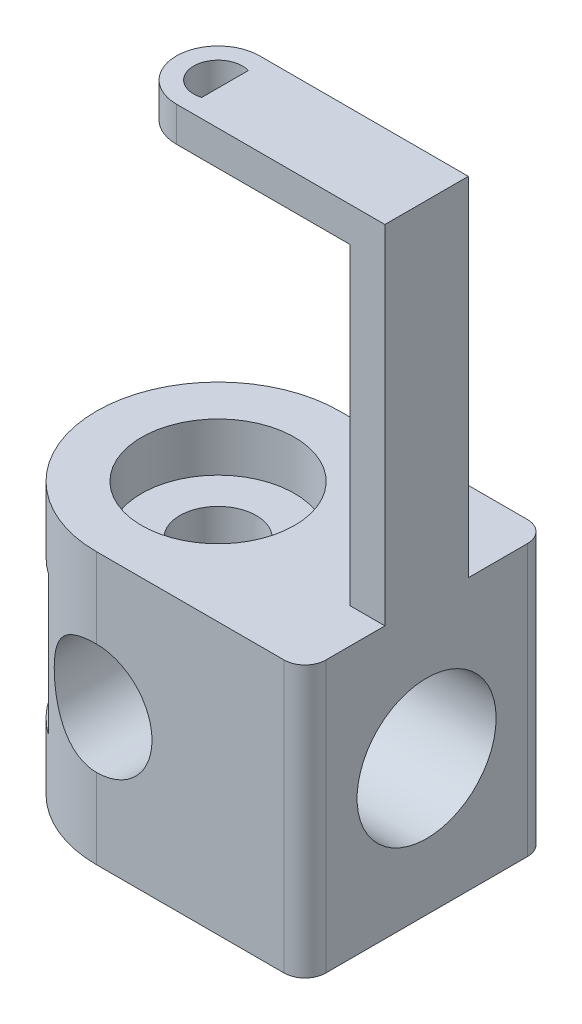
ISO-10303-21;
HEADER;
FILE_DESCRIPTION(('STEP AP214'),'2;1');
FILE_NAME('part.step','',(''),(''),'','','');
FILE_SCHEMA(('AUTOMOTIVE_DESIGN { 1 0 10303 214 1 1 1 1 }'));
ENDSEC;
DATA;
#1=APPLICATION_CONTEXT('core data for automotive mechanical design processes');
#2=APPLICATION_PROTOCOL_DEFINITION('international standard','automotive_design',2000,#1);
#3=PRODUCT_CONTEXT('',#1,'mechanical');
#4=PRODUCT('Part','Part','',(#3));
#5=PRODUCT_RELATED_PRODUCT_CATEGORY('part','',(#4));
#6=PRODUCT_DEFINITION_FORMATION('','',#4);
#7=PRODUCT_DEFINITION_CONTEXT('part definition',#1,'design');
#8=PRODUCT_DEFINITION('design','',#6,#7);
#9=PRODUCT_DEFINITION_SHAPE('','',#8);
#10=(LENGTH_UNIT() NAMED_UNIT(*) SI_UNIT(.MILLI.,.METRE.));
#11=(NAMED_UNIT(*) PLANE_ANGLE_UNIT() SI_UNIT($,.RADIAN.));
#12=(NAMED_UNIT(*) SI_UNIT($,.STERADIAN.) SOLID_ANGLE_UNIT());
#13=UNCERTAINTY_MEASURE_WITH_UNIT(LENGTH_MEASURE(1.E-05),#10,'distance_accuracy_value','');
#14=(GEOMETRIC_REPRESENTATION_CONTEXT(3) GLOBAL_UNCERTAINTY_ASSIGNED_CONTEXT((#13)) GLOBAL_UNIT_ASSIGNED_CONTEXT((#10,
#11,#12)) REPRESENTATION_CONTEXT('',''));
#15=CARTESIAN_POINT('',(0.,0.,0.));
#16=DIRECTION('',(0.,0.,1.));
#17=DIRECTION('',(1.,0.,0.));
#18=AXIS2_PLACEMENT_3D('',#15,#16,#17);
#19=CARTESIAN_POINT('',(-5.,0.,0.));
#20=DIRECTION('',(1.,0.,0.));
#21=DIRECTION('',(0.,0.,-1.));
#22=AXIS2_PLACEMENT_3D('',#19,#20,#21);
#23=PLANE('',#22);
#24=CARTESIAN_POINT('',(-5.,0.,0.));
#25=DIRECTION('',(1.,0.,0.));
#26=DIRECTION('',(0.,0.,-1.));
#27=AXIS2_PLACEMENT_3D('',#24,#25,#26);
#28=CIRCLE('',#27,10.);
#29=CARTESIAN_POINT('',(-5.,0.,-10.));
#30=VERTEX_POINT('',#29);
#31=EDGE_CURVE('E549',#30,#30,#28,.T.);
#32=ORIENTED_EDGE('',*,*,#31,.T.);
#33=EDGE_LOOP('',(#32));
#34=FACE_BOUND('',#33,.T.);
#35=ADVANCED_FACE('F53',(#34),#23,.T.);
#36=CARTESIAN_POINT('',(-14.99996050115,-12.5,0.));
#37=DIRECTION('',(0.,1.,0.));
#38=DIRECTION('',(1.,0.,0.));
#39=AXIS2_PLACEMENT_3D('',#36,#37,#38);
#40=PLANE('',#39);
#41=CARTESIAN_POINT('',(-14.99996050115,-12.5,0.));
#42=DIRECTION('',(0.,-1.,0.));
#43=DIRECTION('',(0.,0.,1.));
#44=AXIS2_PLACEMENT_3D('',#41,#42,#43);
#45=CIRCLE('',#44,5.5);
#46=CARTESIAN_POINT('',(-14.99996050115,-12.5,5.5));
#47=VERTEX_POINT('',#46);
#48=EDGE_CURVE('E11',#47,#47,#45,.T.);
#49=ORIENTED_EDGE('',*,*,#48,.F.);
#50=EDGE_LOOP('',(#49));
#51=FACE_BOUND('',#50,.T.);
#52=CARTESIAN_POINT('',(-14.99996050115,-12.5,0.));
#53=DIRECTION('',(0.,-1.,0.));
#54=DIRECTION('',(0.,0.,1.));
#55=AXIS2_PLACEMENT_3D('',#52,#53,#54);
#56=CIRCLE('',#55,11.);
#57=CARTESIAN_POINT('',(-14.99996050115,-12.5,11.));
#58=VERTEX_POINT('',#57);
#59=CARTESIAN_POINT('',(-3.99996050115,-12.5,0.));
#60=VERTEX_POINT('',#59);
#61=EDGE_CURVE('E490',#58,#60,#56,.T.);
#62=ORIENTED_EDGE('',*,*,#61,.T.);
#63=CARTESIAN_POINT('',(-14.99996050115,-12.5,0.));
#64=DIRECTION('',(0.,-1.,0.));
#65=DIRECTION('',(0.,0.,1.));
#66=AXIS2_PLACEMENT_3D('',#63,#64,#65);
#67=CIRCLE('',#66,11.);
#68=EDGE_CURVE('E540',#60,#58,#67,.T.);
#69=ORIENTED_EDGE('',*,*,#68,.T.);
#70=EDGE_LOOP('',(#62,#69));
#71=FACE_BOUND('',#70,.T.);
#72=ADVANCED_FACE('F596',(#51,#71),#40,.F.);
#73=CARTESIAN_POINT('',(-14.99996050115,12.5,0.));
#74=DIRECTION('',(0.,1.,0.));
#75=DIRECTION('',(0.,0.,1.));
#76=AXIS2_PLACEMENT_3D('',#73,#74,#75);
#77=CYLINDRICAL_SURFACE('',#76,5.5);
#78=CARTESIAN_POINT('',(-14.99996050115,-7.999999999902,5.5));
#79=CARTESIAN_POINT('',(-15.38738832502,-8.000001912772,5.5));
#80=CARTESIAN_POINT('',(-15.77087500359,-7.977488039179,5.467250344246));
#81=CARTESIAN_POINT('',(-16.14461926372,-7.933322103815,5.403003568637));
#82=CARTESIAN_POINT('',(-16.50301971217,-7.870104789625,5.310284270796));
#83=CARTESIAN_POINT('',(-16.8409363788,-7.792081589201,5.193888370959));
#84=CARTESIAN_POINT('',(-17.41154634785,-7.632563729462,4.951027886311));
#85=CARTESIAN_POINT('',(-17.65471076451,-7.553436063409,4.828937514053));
#86=CARTESIAN_POINT('',(-17.88371418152,-7.469002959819,4.696391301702));
#87=CARTESIAN_POINT('',(-18.099075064,-7.380791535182,4.554941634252));
#88=CARTESIAN_POINT('',(-18.30139717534,-7.29008376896,4.405781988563));
#89=CARTESIAN_POINT('',(-18.69946053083,-7.097007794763,4.078759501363));
#90=CARTESIAN_POINT('',(-18.89287151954,-6.994271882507,3.899371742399));
#91=CARTESIAN_POINT('',(-19.07228148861,-6.891213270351,3.71272821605));
#92=CARTESIAN_POINT('',(-19.23839588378,-6.789052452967,3.519543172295));
#93=CARTESIAN_POINT('',(-19.3918003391,-6.688901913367,3.320211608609));
#94=CARTESIAN_POINT('',(-19.69698954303,-6.479039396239,2.876086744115));
#95=CARTESIAN_POINT('',(-19.84454057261,-6.370356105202,2.629020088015));
#96=CARTESIAN_POINT('',(-19.97574617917,-6.267866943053,2.374468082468));
#97=CARTESIAN_POINT('',(-20.09065455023,-6.17361936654,2.113004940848));
#98=CARTESIAN_POINT('',(-20.18916483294,-6.089694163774,1.845014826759));
#99=CARTESIAN_POINT('',(-20.29649242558,-5.995692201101,1.484849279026));
#100=CARTESIAN_POINT('',(-20.32042528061,-5.974499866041,1.398402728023));
#101=CARTESIAN_POINT('',(-20.34268558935,-5.954594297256,1.31141547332));
#102=CARTESIAN_POINT('',(-20.36325717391,-5.936038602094,1.22392414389));
#103=CARTESIAN_POINT('',(-20.38212525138,-5.918890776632,1.135962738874));
#104=CARTESIAN_POINT('',(-20.43259326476,-5.872730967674,0.875842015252));
#105=CARTESIAN_POINT('',(-20.45944399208,-5.847757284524,0.702397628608));
#106=CARTESIAN_POINT('',(-20.47967459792,-5.828718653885,0.527680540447));
#107=CARTESIAN_POINT('',(-20.49319451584,-5.815917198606,0.352114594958));
#108=CARTESIAN_POINT('',(-20.49996050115,-5.809512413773,0.176097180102));
#109=CARTESIAN_POINT('',(-20.49996050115,-5.809512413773,-0.261301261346));
#110=CARTESIAN_POINT('',(-20.48506356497,-5.82361554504,-0.522133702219));
#111=CARTESIAN_POINT('',(-20.45536886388,-5.851728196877,-0.781476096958));
#112=CARTESIAN_POINT('',(-20.41106531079,-5.893127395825,-1.038252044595));
#113=CARTESIAN_POINT('',(-20.35246388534,-5.946457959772,-1.291223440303));
#114=CARTESIAN_POINT('',(-20.19779786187,-6.082347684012,-1.821920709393));
#115=CARTESIAN_POINT('',(-20.09750049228,-6.168061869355,-2.098296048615));
#116=CARTESIAN_POINT('',(-19.97981175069,-6.264829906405,-2.367786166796));
#117=CARTESIAN_POINT('',(-19.84484454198,-6.370377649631,-2.629971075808));
#118=CARTESIAN_POINT('',(-19.69254873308,-6.482467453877,-2.884216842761));
#119=CARTESIAN_POINT('',(-19.32698688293,-6.733014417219,-3.412498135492));
#120=CARTESIAN_POINT('',(-19.10795142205,-6.872898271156,-3.683671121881));
#121=CARTESIAN_POINT('',(-18.86445050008,-7.015672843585,-3.94302028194));
#122=CARTESIAN_POINT('',(-18.59460950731,-7.158529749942,-4.189352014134));
#123=CARTESIAN_POINT('',(-18.29622228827,-7.297972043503,-4.420102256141));
#124=CARTESIAN_POINT('',(-17.74304016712,-7.518911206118,-4.774560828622));
#125=CARTESIAN_POINT('',(-17.50393799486,-7.60499151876,-4.909391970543));
#126=CARTESIAN_POINT('',(-17.24980020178,-7.68583014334,-5.033472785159));
#127=CARTESIAN_POINT('',(-16.98062239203,-7.759489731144,-5.144725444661));
#128=CARTESIAN_POINT('',(-16.69661563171,-7.823893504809,-5.240851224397));
#129=CARTESIAN_POINT('',(-16.0383750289,-7.940742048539,-5.413886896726));
#130=CARTESIAN_POINT('',(-15.65598897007,-7.988268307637,-5.483168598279));
#131=CARTESIAN_POINT('',(-15.26000476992,-8.01382179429,-5.519958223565));
#132=CARTESIAN_POINT('',(-14.85989909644,-8.014597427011,-5.521194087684));
#133=CARTESIAN_POINT('',(-14.46529152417,-7.991263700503,-5.487488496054));
#134=CARTESIAN_POINT('',(-13.86762701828,-7.922486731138,-5.386706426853));
#135=CARTESIAN_POINT('',(-13.65506841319,-7.890769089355,-5.340068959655));
#136=CARTESIAN_POINT('',(-13.44845091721,-7.85302945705,-5.28428450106));
#137=CARTESIAN_POINT('',(-13.24841407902,-7.809995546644,-5.220197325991));
#138=CARTESIAN_POINT('',(-13.05553539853,-7.762472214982,-5.148743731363));
#139=CARTESIAN_POINT('',(-12.61008604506,-7.639450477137,-4.961670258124));
#140=CARTESIAN_POINT('',(-12.36452216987,-7.560288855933,-4.83968829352));
#141=CARTESIAN_POINT('',(-12.13329886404,-7.475668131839,-4.707034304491));
#142=CARTESIAN_POINT('',(-11.91589998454,-7.387153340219,-4.565304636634));
#143=CARTESIAN_POINT('',(-11.71171903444,-7.296059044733,-4.415730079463));
#144=CARTESIAN_POINT('',(-11.3063022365,-7.10021073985,-4.08449943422));
#145=CARTESIAN_POINT('',(-11.10796569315,-6.995003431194,-3.900973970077));
#146=CARTESIAN_POINT('',(-10.92431592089,-6.889444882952,-3.709838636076));
#147=CARTESIAN_POINT('',(-10.75459473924,-6.784844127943,-3.511860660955));
#148=CARTESIAN_POINT('',(-10.59817614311,-6.682392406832,-3.307457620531));
#149=CARTESIAN_POINT('',(-10.29187205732,-6.470908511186,-2.857879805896));
#150=CARTESIAN_POINT('',(-10.14556428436,-6.362760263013,-2.610752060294));
#151=CARTESIAN_POINT('',(-10.01554068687,-6.260881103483,-2.356181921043));
#152=CARTESIAN_POINT('',(-9.901766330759,-6.16731616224,-2.094745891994));
#153=CARTESIAN_POINT('',(-9.804350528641,-6.08413900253,-1.826832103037));
#154=CARTESIAN_POINT('',(-9.650180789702,-5.948864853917,-1.30292911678));
#155=CARTESIAN_POINT('',(-9.590502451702,-5.894593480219,-1.047753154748));
#156=CARTESIAN_POINT('',(-9.545380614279,-5.852438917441,-0.788674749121));
#157=CARTESIAN_POINT('',(-9.515135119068,-5.823804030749,-0.526964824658));
#158=CARTESIAN_POINT('',(-9.49996050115,-5.80943762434,-0.263725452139));
#159=CARTESIAN_POINT('',(-9.49996050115,-5.80943762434,0.175574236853));
#160=CARTESIAN_POINT('',(-9.506686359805,-5.815804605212,0.351069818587));
#161=CARTESIAN_POINT('',(-9.520126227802,-5.828530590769,0.526117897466));
#162=CARTESIAN_POINT('',(-9.54023731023,-5.84745793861,0.700324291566));
#163=CARTESIAN_POINT('',(-9.566930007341,-5.872287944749,0.873268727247));
#164=CARTESIAN_POINT('',(-9.617108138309,-5.918193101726,1.132681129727));
#165=CARTESIAN_POINT('',(-9.635872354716,-5.935251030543,1.220422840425));
#166=CARTESIAN_POINT('',(-9.656331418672,-5.953710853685,1.307697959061));
#167=CARTESIAN_POINT('',(-9.678470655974,-5.97351511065,1.394472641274));
#168=CARTESIAN_POINT('',(-9.702274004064,-5.994601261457,1.480710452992));
#169=CARTESIAN_POINT('',(-9.80874178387,-6.087893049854,1.839069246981));
#170=CARTESIAN_POINT('',(-9.906331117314,-6.171090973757,2.105545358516));
#171=CARTESIAN_POINT('',(-10.0201251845,-6.26452156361,2.365583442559));
#172=CARTESIAN_POINT('',(-10.15002055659,-6.366140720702,2.61880334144));
#173=CARTESIAN_POINT('',(-10.2960578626,-6.473934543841,2.864639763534));
#174=CARTESIAN_POINT('',(-10.65536239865,-6.721707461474,3.390629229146));
#175=CARTESIAN_POINT('',(-10.87632236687,-6.863652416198,3.666943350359));
#176=CARTESIAN_POINT('',(-11.12246798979,-7.008733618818,3.931124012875));
#177=CARTESIAN_POINT('',(-11.39574003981,-7.154013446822,4.181943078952));
#178=CARTESIAN_POINT('',(-11.6984350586,-7.29583408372,4.416729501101));
#179=CARTESIAN_POINT('',(-12.25688071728,-7.518882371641,4.77456075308));
#180=CARTESIAN_POINT('',(-12.4959827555,-7.604965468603,4.909391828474));
#181=CARTESIAN_POINT('',(-12.75012044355,-7.685806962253,5.033472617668));
#182=CARTESIAN_POINT('',(-13.01929822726,-7.759469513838,5.144725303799));
#183=CARTESIAN_POINT('',(-13.30330509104,-7.823876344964,5.240851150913));
#184=CARTESIAN_POINT('',(-13.82117604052,-7.915812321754,5.376987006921));
#185=CARTESIAN_POINT('',(-14.04849859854,-7.948595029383,5.425121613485));
#186=CARTESIAN_POINT('',(-14.28187782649,-7.974039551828,5.462244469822));
#187=CARTESIAN_POINT('',(-14.5194949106,-7.991323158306,5.487382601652));
#188=CARTESIAN_POINT('',(-14.75948272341,-7.999998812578,5.5));
#189=CARTESIAN_POINT('',(-14.99996050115,-7.999999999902,5.5));
#190=(BOUNDED_CURVE() B_SPLINE_CURVE(6,(#78,#79,#80,#81,#82,#83,#84,#85,#86,#87,#88,#89,#90,#91,
#92,#93,#94,#95,#96,#97,#98,#99,#100,#101,#102,#103,#104,#105,#106,#107,#108,#109,#110,#111,
#112,#113,#114,#115,#116,#117,#118,#119,#120,#121,#122,#123,#124,#125,#126,#127,#128,#129,#130,
#131,#132,#133,#134,#135,#136,#137,#138,#139,#140,#141,#142,#143,#144,#145,#146,#147,#148,#149,
#150,#151,#152,#153,#154,#155,#156,#157,#158,#159,#160,#161,#162,#163,#164,#165,#166,#167,#168,
#169,#170,#171,#172,#173,#174,#175,#176,#177,#178,#179,#180,#181,#182,#183,#184,#185,#186,#187,
#188,#189),.UNSPECIFIED.,.T.,.F.) B_SPLINE_CURVE_WITH_KNOTS((7,5,5,5,5,5,5,5,5,5,5,5,5,5,5,5,5,
5,5,5,5,5,7),(0.,0.05273742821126,0.0961618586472,0.14376396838,0.199129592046,0.216461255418,
0.250128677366,0.300085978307,0.357175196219,0.422960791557,0.467800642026,0.521891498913,
0.55290493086,0.5964836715,0.645123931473,0.700285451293,0.750530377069,0.783980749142,
0.801205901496,0.856040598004,0.922549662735,0.967168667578,1.),
.UNSPECIFIED.) CURVE() GEOMETRIC_REPRESENTATION_ITEM() RATIONAL_B_SPLINE_CURVE((1.,1.,1.,1.,1.,
1.,1.,1.,1.,1.,1.,1.,1.,1.,1.,1.,1.,1.,1.,1.,1.,1.,1.,1.,1.,1.,1.,1.,1.,1.,1.,1.,1.,1.,1.,1.,1.,
1.,1.,1.,1.,1.,1.,1.,1.,1.,1.,1.,1.,1.,1.,1.,1.,1.,1.,1.,1.,1.,1.,1.,1.,1.,1.,1.,1.,1.,1.,1.,1.,
1.,1.,1.,1.,1.,1.,1.,1.,1.,1.,1.,1.,1.,1.,1.,1.,1.,1.,1.,1.,1.,1.,1.,1.,1.,1.,1.,1.,1.,1.,1.,1.,
1.,1.,1.,1.,1.,1.,1.,1.,1.,1.,1.)) REPRESENTATION_ITEM(''));
#191=CARTESIAN_POINT('',(-14.99996050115,-7.999999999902,5.5));
#192=VERTEX_POINT('',#191);
#193=EDGE_CURVE('E366',#192,#192,#190,.T.);
#194=ORIENTED_EDGE('',*,*,#193,.F.);
#195=DIRECTION('',(0.,-1.,0.));
#196=VECTOR('',#195,1.);
#197=CARTESIAN_POINT('',(-14.99996050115,12.5,5.5));
#198=LINE('',#197,#196);
#199=EDGE_CURVE('E56',#192,#47,#198,.T.);
#200=ORIENTED_EDGE('',*,*,#199,.T.);
#201=ORIENTED_EDGE('',*,*,#48,.T.);
#202=ORIENTED_EDGE('',*,*,#199,.F.);
#203=EDGE_LOOP('',(#194,#200,#201,#202));
#204=FACE_BOUND('',#203,.T.);
#205=ADVANCED_FACE('F602',(#204),#77,.F.);
#206=CARTESIAN_POINT('',(-14.99996050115,12.5,0.));
#207=DIRECTION('',(0.,1.,0.));
#208=DIRECTION('',(0.,0.,1.));
#209=AXIS2_PLACEMENT_3D('',#206,#207,#208);
#210=CYLINDRICAL_SURFACE('',#209,5.5);
#211=CARTESIAN_POINT('',(-14.99996050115,12.5,0.));
#212=DIRECTION('',(0.,-1.,0.));
#213=DIRECTION('',(0.,0.,1.));
#214=AXIS2_PLACEMENT_3D('',#211,#212,#213);
#215=CIRCLE('',#214,5.5);
#216=CARTESIAN_POINT('',(-14.99996050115,12.5,5.5));
#217=VERTEX_POINT('',#216);
#218=EDGE_CURVE('E553',#217,#217,#215,.T.);
#219=ORIENTED_EDGE('',*,*,#218,.F.);
#220=DIRECTION('',(0.,-1.,0.));
#221=VECTOR('',#220,1.);
#222=CARTESIAN_POINT('',(-14.99996050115,12.5,5.5));
#223=LINE('',#222,#221);
#224=CARTESIAN_POINT('',(-14.99996050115,7.999999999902,5.5));
#225=VERTEX_POINT('',#224);
#226=EDGE_CURVE('E550',#217,#225,#223,.T.);
#227=ORIENTED_EDGE('',*,*,#226,.T.);
#228=CARTESIAN_POINT('',(-14.99996050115,7.999999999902,5.5));
#229=CARTESIAN_POINT('',(-15.38738832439,8.000001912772,5.5));
#230=CARTESIAN_POINT('',(-15.77087500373,7.977488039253,5.467250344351));
#231=CARTESIAN_POINT('',(-16.14461926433,7.933322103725,5.403003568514));
#232=CARTESIAN_POINT('',(-16.50301971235,7.870104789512,5.310284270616));
#233=CARTESIAN_POINT('',(-16.84093637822,7.792081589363,5.193888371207));
#234=CARTESIAN_POINT('',(-17.41154634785,7.632563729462,4.951027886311));
#235=CARTESIAN_POINT('',(-17.65471076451,7.553436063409,4.828937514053));
#236=CARTESIAN_POINT('',(-17.88371418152,7.469002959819,4.696391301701));
#237=CARTESIAN_POINT('',(-18.099075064,7.380791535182,4.554941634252));
#238=CARTESIAN_POINT('',(-18.30139717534,7.29008376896,4.405781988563));
#239=CARTESIAN_POINT('',(-18.69946051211,7.097007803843,4.078759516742));
#240=CARTESIAN_POINT('',(-18.89287154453,6.994271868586,3.899371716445));
#241=CARTESIAN_POINT('',(-19.07228149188,6.891213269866,3.712728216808));
#242=CARTESIAN_POINT('',(-19.23839586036,6.789052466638,3.519543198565));
#243=CARTESIAN_POINT('',(-19.39180035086,6.68890190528,3.320211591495));
#244=CARTESIAN_POINT('',(-19.69698954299,6.47903939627,2.876086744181));
#245=CARTESIAN_POINT('',(-19.84454057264,6.370356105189,2.629020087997));
#246=CARTESIAN_POINT('',(-19.9757461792,6.267866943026,2.374468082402));
#247=CARTESIAN_POINT('',(-20.09065455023,6.173619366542,2.113004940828));
#248=CARTESIAN_POINT('',(-20.18916483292,6.089694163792,1.845014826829));
#249=CARTESIAN_POINT('',(-20.29649242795,5.995692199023,1.484849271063));
#250=CARTESIAN_POINT('',(-20.32042528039,5.974499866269,1.398402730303));
#251=CARTESIAN_POINT('',(-20.34268558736,5.95459429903,1.311415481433));
#252=CARTESIAN_POINT('',(-20.36325717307,5.936038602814,1.223924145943));
#253=CARTESIAN_POINT('',(-20.38212525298,5.918890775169,1.135962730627));
#254=CARTESIAN_POINT('',(-20.43259326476,5.872730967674,0.875842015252));
#255=CARTESIAN_POINT('',(-20.45944399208,5.847757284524,0.702397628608));
#256=CARTESIAN_POINT('',(-20.47967459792,5.828718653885,0.527680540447));
#257=CARTESIAN_POINT('',(-20.49319451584,5.815917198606,0.352114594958));
#258=CARTESIAN_POINT('',(-20.49996050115,5.809512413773,0.176097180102));
#259=CARTESIAN_POINT('',(-20.49996050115,5.809512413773,-0.261301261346));
#260=CARTESIAN_POINT('',(-20.48506356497,5.82361554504,-0.52213370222));
#261=CARTESIAN_POINT('',(-20.45536886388,5.851728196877,-0.781476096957));
#262=CARTESIAN_POINT('',(-20.41106531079,5.893127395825,-1.038252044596));
#263=CARTESIAN_POINT('',(-20.35246388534,5.946457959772,-1.291223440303));
#264=CARTESIAN_POINT('',(-20.19779786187,6.082347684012,-1.821920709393));
#265=CARTESIAN_POINT('',(-20.09750049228,6.168061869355,-2.098296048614));
#266=CARTESIAN_POINT('',(-19.97981175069,6.264829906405,-2.367786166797));
#267=CARTESIAN_POINT('',(-19.84484454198,6.370377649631,-2.629971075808));
#268=CARTESIAN_POINT('',(-19.69254873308,6.482467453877,-2.88421684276));
#269=CARTESIAN_POINT('',(-19.32698688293,6.733014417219,-3.412498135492));
#270=CARTESIAN_POINT('',(-19.10795142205,6.872898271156,-3.683671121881));
#271=CARTESIAN_POINT('',(-18.86445050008,7.015672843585,-3.94302028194));
#272=CARTESIAN_POINT('',(-18.59460950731,7.158529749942,-4.189352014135));
#273=CARTESIAN_POINT('',(-18.29622228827,7.297972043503,-4.420102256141));
#274=CARTESIAN_POINT('',(-17.74304016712,7.518911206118,-4.774560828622));
#275=CARTESIAN_POINT('',(-17.50393799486,7.60499151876,-4.909391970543));
#276=CARTESIAN_POINT('',(-17.24980020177,7.68583014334,-5.033472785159));
#277=CARTESIAN_POINT('',(-16.98062239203,7.759489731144,-5.144725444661));
#278=CARTESIAN_POINT('',(-16.69661563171,7.823893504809,-5.240851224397));
#279=CARTESIAN_POINT('',(-16.0383750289,7.940742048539,-5.413886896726));
#280=CARTESIAN_POINT('',(-15.65598897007,7.988268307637,-5.483168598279));
#281=CARTESIAN_POINT('',(-15.26000476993,8.01382179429,-5.519958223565));
#282=CARTESIAN_POINT('',(-14.85989909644,8.014597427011,-5.521194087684));
#283=CARTESIAN_POINT('',(-14.46529152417,7.991263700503,-5.487488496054));
#284=CARTESIAN_POINT('',(-13.86762701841,7.922486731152,-5.386706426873));
#285=CARTESIAN_POINT('',(-13.65506841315,7.890769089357,-5.340068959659));
#286=CARTESIAN_POINT('',(-13.4484509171,7.853029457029,-5.284284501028));
#287=CARTESIAN_POINT('',(-13.248414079,7.80999554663,-5.220197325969));
#288=CARTESIAN_POINT('',(-13.05553539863,7.762472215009,-5.148743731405));
#289=CARTESIAN_POINT('',(-12.61008604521,7.639450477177,-4.961670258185));
#290=CARTESIAN_POINT('',(-12.36452216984,7.560288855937,-4.839688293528));
#291=CARTESIAN_POINT('',(-12.13329886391,7.47566813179,-4.707034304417));
#292=CARTESIAN_POINT('',(-11.9158999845,7.387153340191,-4.565304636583));
#293=CARTESIAN_POINT('',(-11.71171903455,7.296059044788,-4.415730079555));
#294=CARTESIAN_POINT('',(-11.30630225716,7.10021074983,-4.084499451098));
#295=CARTESIAN_POINT('',(-11.10796566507,6.995003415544,-3.900973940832));
#296=CARTESIAN_POINT('',(-10.92431591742,6.88944488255,-3.709838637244));
#297=CARTESIAN_POINT('',(-10.75459476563,6.784844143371,-3.511860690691));
#298=CARTESIAN_POINT('',(-10.5981761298,6.682392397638,-3.307457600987));
#299=CARTESIAN_POINT('',(-10.29187205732,6.470908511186,-2.857879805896));
#300=CARTESIAN_POINT('',(-10.14556428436,6.362760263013,-2.610752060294));
#301=CARTESIAN_POINT('',(-10.01554068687,6.260881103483,-2.356181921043));
#302=CARTESIAN_POINT('',(-9.901766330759,6.16731616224,-2.094745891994));
#303=CARTESIAN_POINT('',(-9.804350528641,6.08413900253,-1.826832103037));
#304=CARTESIAN_POINT('',(-9.650180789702,5.948864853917,-1.30292911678));
#305=CARTESIAN_POINT('',(-9.590502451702,5.894593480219,-1.047753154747));
#306=CARTESIAN_POINT('',(-9.54538061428,5.852438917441,-0.788674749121));
#307=CARTESIAN_POINT('',(-9.515135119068,5.823804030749,-0.526964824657));
#308=CARTESIAN_POINT('',(-9.49996050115,5.80943762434,-0.263725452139));
#309=CARTESIAN_POINT('',(-9.49996050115,5.80943762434,0.175574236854));
#310=CARTESIAN_POINT('',(-9.506686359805,5.815804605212,0.351069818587));
#311=CARTESIAN_POINT('',(-9.520126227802,5.828530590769,0.526117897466));
#312=CARTESIAN_POINT('',(-9.54023731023,5.84745793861,0.700324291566));
#313=CARTESIAN_POINT('',(-9.566930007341,5.872287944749,0.873268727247));
#314=CARTESIAN_POINT('',(-9.61710813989,5.918193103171,1.132681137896));
#315=CARTESIAN_POINT('',(-9.635872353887,5.935251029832,1.220422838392));
#316=CARTESIAN_POINT('',(-9.65633141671,5.953710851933,1.307697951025));
#317=CARTESIAN_POINT('',(-9.678470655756,5.973515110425,1.394472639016));
#318=CARTESIAN_POINT('',(-9.702274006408,5.99460126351,1.48071046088));
#319=CARTESIAN_POINT('',(-9.80874178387,6.087893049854,1.839069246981));
#320=CARTESIAN_POINT('',(-9.906331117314,6.171090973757,2.105545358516));
#321=CARTESIAN_POINT('',(-10.0201251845,6.26452156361,2.365583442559));
#322=CARTESIAN_POINT('',(-10.15002055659,6.366140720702,2.618803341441));
#323=CARTESIAN_POINT('',(-10.29605786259,6.473934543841,2.864639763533));
#324=CARTESIAN_POINT('',(-10.65536239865,6.721707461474,3.390629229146));
#325=CARTESIAN_POINT('',(-10.87632236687,6.863652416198,3.666943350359));
#326=CARTESIAN_POINT('',(-11.12246798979,7.008733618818,3.931124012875));
#327=CARTESIAN_POINT('',(-11.39574003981,7.154013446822,4.181943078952));
#328=CARTESIAN_POINT('',(-11.6984350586,7.29583408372,4.416729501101));
#329=CARTESIAN_POINT('',(-12.25688071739,7.518882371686,4.774560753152));
#330=CARTESIAN_POINT('',(-12.49598275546,7.604965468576,4.909391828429));
#331=CARTESIAN_POINT('',(-12.75012044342,7.685806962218,5.033472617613));
#332=CARTESIAN_POINT('',(-13.01929822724,7.759469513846,5.144725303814));
#333=CARTESIAN_POINT('',(-13.30330509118,7.823876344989,5.240851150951));
#334=CARTESIAN_POINT('',(-13.82117604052,7.915812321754,5.376987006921));
#335=CARTESIAN_POINT('',(-14.04849859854,7.948595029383,5.425121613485));
#336=CARTESIAN_POINT('',(-14.28187782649,7.974039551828,5.462244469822));
#337=CARTESIAN_POINT('',(-14.5194949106,7.991323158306,5.487382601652));
#338=CARTESIAN_POINT('',(-14.75948272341,7.999998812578,5.5));
#339=CARTESIAN_POINT('',(-14.99996050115,7.999999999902,5.5));
#340=(BOUNDED_CURVE() B_SPLINE_CURVE(6,(#228,#229,#230,#231,#232,#233,#234,#235,#236,#237,#238,
#239,#240,#241,#242,#243,#244,#245,#246,#247,#248,#249,#250,#251,#252,#253,#254,#255,#256,#257,
#258,#259,#260,#261,#262,#263,#264,#265,#266,#267,#268,#269,#270,#271,#272,#273,#274,#275,#276,
#277,#278,#279,#280,#281,#282,#283,#284,#285,#286,#287,#288,#289,#290,#291,#292,#293,#294,#295,
#296,#297,#298,#299,#300,#301,#302,#303,#304,#305,#306,#307,#308,#309,#310,#311,#312,#313,#314,
#315,#316,#317,#318,#319,#320,#321,#322,#323,#324,#325,#326,#327,#328,#329,#330,#331,#332,#333,
#334,#335,#336,#337,#338,#339),.UNSPECIFIED.,.T.,.F.) B_SPLINE_CURVE_WITH_KNOTS((7,5,5,5,5,5,5,
5,5,5,5,5,5,5,5,5,5,5,5,5,5,5,7),(0.,0.05273741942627,0.09616184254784,0.143763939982,
0.199129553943,0.21646121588,0.250128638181,0.300085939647,0.357175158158,0.422960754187,
0.467800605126,0.52189146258,0.552904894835,0.59648363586,0.645123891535,0.700285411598,
0.750530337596,0.783980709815,0.801205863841,0.856040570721,0.922549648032,0.967168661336,1.),
.UNSPECIFIED.) CURVE() GEOMETRIC_REPRESENTATION_ITEM() RATIONAL_B_SPLINE_CURVE((1.,1.,1.,1.,1.,
1.,1.,1.,1.,1.,1.,1.,1.,1.,1.,1.,1.,1.,1.,1.,1.,1.,1.,1.,1.,1.,1.,1.,1.,1.,1.,1.,1.,1.,1.,1.,1.,
1.,1.,1.,1.,1.,1.,1.,1.,1.,1.,1.,1.,1.,1.,1.,1.,1.,1.,1.,1.,1.,1.,1.,1.,1.,1.,1.,1.,1.,1.,1.,1.,
1.,1.,1.,1.,1.,1.,1.,1.,1.,1.,1.,1.,1.,1.,1.,1.,1.,1.,1.,1.,1.,1.,1.,1.,1.,1.,1.,1.,1.,1.,1.,1.,
1.,1.,1.,1.,1.,1.,1.,1.,1.,1.,1.)) REPRESENTATION_ITEM(''));
#341=EDGE_CURVE('E373',#225,#225,#340,.T.);
#342=ORIENTED_EDGE('',*,*,#341,.T.);
#343=ORIENTED_EDGE('',*,*,#226,.F.);
#344=EDGE_LOOP('',(#219,#227,#342,#343));
#345=FACE_BOUND('',#344,.T.);
#346=ADVANCED_FACE('F563',(#345),#210,.F.);
#347=CARTESIAN_POINT('',(-14.99996050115,12.5,0.));
#348=DIRECTION('',(0.,1.,0.));
#349=DIRECTION('',(1.,0.,0.));
#350=AXIS2_PLACEMENT_3D('',#347,#348,#349);
#351=PLANE('',#350);
#352=ORIENTED_EDGE('',*,*,#218,.T.);
#353=EDGE_LOOP('',(#352));
#354=FACE_BOUND('',#353,.T.);
#355=CARTESIAN_POINT('',(-14.99996050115,12.5,0.));
#356=DIRECTION('',(0.,-1.,0.));
#357=DIRECTION('',(0.,0.,1.));
#358=AXIS2_PLACEMENT_3D('',#355,#356,#357);
#359=CIRCLE('',#358,11.);
#360=CARTESIAN_POINT('',(-3.99996050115,12.5,0.));
#361=VERTEX_POINT('',#360);
#362=CARTESIAN_POINT('',(-14.99996050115,12.5,11.));
#363=VERTEX_POINT('',#362);
#364=EDGE_CURVE('E495',#361,#363,#359,.T.);
#365=ORIENTED_EDGE('',*,*,#364,.F.);
#366=CARTESIAN_POINT('',(-14.99996050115,12.5,0.));
#367=DIRECTION('',(0.,-1.,0.));
#368=DIRECTION('',(0.,0.,1.));
#369=AXIS2_PLACEMENT_3D('',#366,#367,#368);
#370=CIRCLE('',#369,11.);
#371=EDGE_CURVE('E499',#363,#361,#370,.T.);
#372=ORIENTED_EDGE('',*,*,#371,.F.);
#373=EDGE_LOOP('',(#365,#372));
#374=FACE_BOUND('',#373,.T.);
#375=ADVANCED_FACE('F560',(#354,#374),#351,.T.);
#376=CARTESIAN_POINT('',(15.,0.,0.));
#377=DIRECTION('',(1.,0.,0.));
#378=DIRECTION('',(0.,0.,-1.));
#379=AXIS2_PLACEMENT_3D('',#376,#377,#378);
#380=CYLINDRICAL_SURFACE('',#379,10.);
#381=CARTESIAN_POINT('',(15.,0.,0.));
#382=DIRECTION('',(1.,0.,0.));
#383=DIRECTION('',(0.,0.,-1.));
#384=AXIS2_PLACEMENT_3D('',#381,#382,#383);
#385=CIRCLE('',#384,10.);
#386=CARTESIAN_POINT('',(15.,0.,-10.));
#387=VERTEX_POINT('',#386);
#388=EDGE_CURVE('E505',#387,#387,#385,.T.);
#389=ORIENTED_EDGE('',*,*,#388,.T.);
#390=DIRECTION('',(-1.,0.,0.));
#391=VECTOR('',#390,1.);
#392=CARTESIAN_POINT('',(15.,0.,-10.));
#393=LINE('',#392,#391);
#394=EDGE_CURVE('E493',#387,#30,#393,.T.);
#395=ORIENTED_EDGE('',*,*,#394,.T.);
#396=ORIENTED_EDGE('',*,*,#31,.F.);
#397=ORIENTED_EDGE('',*,*,#394,.F.);
#398=EDGE_LOOP('',(#389,#395,#396,#397));
#399=FACE_BOUND('',#398,.T.);
#400=ADVANCED_FACE('F579',(#399),#380,.F.);
#401=CARTESIAN_POINT('',(-15.,0.,-11.49999999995));
#402=DIRECTION('',(0.,0.,1.));
#403=DIRECTION('',(1.,0.,0.));
#404=AXIS2_PLACEMENT_3D('',#401,#402,#403);
#405=PLANE('',#404);
#406=CARTESIAN_POINT('',(-15.,0.,-11.49999999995));
#407=DIRECTION('',(0.,0.,1.));
#408=DIRECTION('',(1.,0.,0.));
#409=AXIS2_PLACEMENT_3D('',#406,#407,#408);
#410=CIRCLE('',#409,4.);
#411=CARTESIAN_POINT('',(-11.,0.,-11.49999999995));
#412=VERTEX_POINT('',#411);
#413=EDGE_CURVE('E430',#412,#412,#410,.T.);
#414=ORIENTED_EDGE('',*,*,#413,.F.);
#415=EDGE_LOOP('',(#414));
#416=FACE_BOUND('',#415,.T.);
#417=CARTESIAN_POINT('',(-15.,0.,-11.49999999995));
#418=DIRECTION('',(0.,0.,1.));
#419=DIRECTION('',(1.,0.,0.));
#420=AXIS2_PLACEMENT_3D('',#417,#418,#419);
#421=CIRCLE('',#420,8.);
#422=CARTESIAN_POINT('',(-7.,0.,-11.49999999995));
#423=VERTEX_POINT('',#422);
#424=EDGE_CURVE('E520',#423,#423,#421,.T.);
#425=ORIENTED_EDGE('',*,*,#424,.T.);
#426=EDGE_LOOP('',(#425));
#427=FACE_BOUND('',#426,.T.);
#428=ADVANCED_FACE('F576',(#416,#427),#405,.T.);
#429=CARTESIAN_POINT('',(-14.99996050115,19.5,0.));
#430=DIRECTION('',(0.,1.,0.));
#431=DIRECTION('',(1.,0.,0.));
#432=AXIS2_PLACEMENT_3D('',#429,#430,#431);
#433=CYLINDRICAL_SURFACE('',#432,11.);
#434=ORIENTED_EDGE('',*,*,#68,.F.);
#435=DIRECTION('',(0.,-1.,0.));
#436=VECTOR('',#435,1.);
#437=CARTESIAN_POINT('',(-3.99996050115,19.5,0.));
#438=LINE('',#437,#436);
#439=CARTESIAN_POINT('',(-3.99996050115,-19.5,0.));
#440=VERTEX_POINT('',#439);
#441=EDGE_CURVE('E494',#60,#440,#438,.T.);
#442=ORIENTED_EDGE('',*,*,#441,.T.);
#443=CARTESIAN_POINT('',(-14.99996050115,-19.5,0.));
#444=DIRECTION('',(0.,-1.,0.));
#445=DIRECTION('',(1.,0.,0.));
#446=AXIS2_PLACEMENT_3D('',#443,#444,#445);
#447=CIRCLE('',#446,11.);
#448=EDGE_CURVE('E431',#440,#440,#447,.T.);
#449=ORIENTED_EDGE('',*,*,#448,.T.);
#450=ORIENTED_EDGE('',*,*,#441,.F.);
#451=ORIENTED_EDGE('',*,*,#61,.F.);
#452=EDGE_LOOP('',(#434,#442,#449,#450,#451));
#453=FACE_BOUND('',#452,.T.);
#454=ADVANCED_FACE('F578',(#453),#433,.F.);
#455=CARTESIAN_POINT('',(-25.,10.,60.653568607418));
#456=DIRECTION('',(0.,1.,0.));
#457=DIRECTION('',(1.,0.,0.));
#458=AXIS2_PLACEMENT_3D('',#455,#456,#457);
#459=PLANE('',#458);
#460=DIRECTION('',(0.,0.,-1.));
#461=VECTOR('',#460,1.);
#462=CARTESIAN_POINT('',(-25.,10.,60.653568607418));
#463=LINE('',#462,#461);
#464=CARTESIAN_POINT('',(-25.,10.,14.361379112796));
#465=VERTEX_POINT('',#464);
#466=CARTESIAN_POINT('',(-25.,10.,-14.36137911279));
#467=VERTEX_POINT('',#466);
#468=EDGE_CURVE('E372',#465,#467,#463,.T.);
#469=ORIENTED_EDGE('',*,*,#468,.F.);
#470=CARTESIAN_POINT('',(-14.99996050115,10.,0.));
#471=DIRECTION('',(0.,1.,0.));
#472=DIRECTION('',(1.,0.,0.));
#473=AXIS2_PLACEMENT_3D('',#470,#471,#472);
#474=CIRCLE('',#473,17.5);
#475=EDGE_CURVE('E460',#467,#465,#474,.T.);
#476=ORIENTED_EDGE('',*,*,#475,.F.);
#477=EDGE_LOOP('',(#469,#476));
#478=FACE_BOUND('',#477,.T.);
#479=ADVANCED_FACE('F586',(#478),#459,.F.);
#480=CARTESIAN_POINT('',(-35.,-10.,60.653568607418));
#481=DIRECTION('',(0.,-1.,0.));
#482=DIRECTION('',(0.,0.,-1.));
#483=AXIS2_PLACEMENT_3D('',#480,#481,#482);
#484=PLANE('',#483);
#485=CARTESIAN_POINT('',(-14.99996050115,-10.,0.));
#486=DIRECTION('',(0.,1.,0.));
#487=DIRECTION('',(1.,0.,0.));
#488=AXIS2_PLACEMENT_3D('',#485,#486,#487);
#489=CIRCLE('',#488,17.5);
#490=CARTESIAN_POINT('',(-25.,-10.,-14.36137911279));
#491=VERTEX_POINT('',#490);
#492=CARTESIAN_POINT('',(-25.,-10.,14.361379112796));
#493=VERTEX_POINT('',#492);
#494=EDGE_CURVE('E468',#491,#493,#489,.T.);
#495=ORIENTED_EDGE('',*,*,#494,.T.);
#496=DIRECTION('',(0.,0.,-1.));
#497=VECTOR('',#496,1.);
#498=CARTESIAN_POINT('',(-25.,-10.,60.653568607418));
#499=LINE('',#498,#497);
#500=EDGE_CURVE('E537',#493,#491,#499,.T.);
#501=ORIENTED_EDGE('',*,*,#500,.T.);
#502=EDGE_LOOP('',(#495,#501));
#503=FACE_BOUND('',#502,.T.);
#504=ADVANCED_FACE('F686',(#503),#484,.F.);
#505=CARTESIAN_POINT('',(-25.,-10.,60.653568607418));
#506=DIRECTION('',(1.,0.,0.));
#507=DIRECTION('',(0.,1.,0.));
#508=AXIS2_PLACEMENT_3D('',#505,#506,#507);
#509=PLANE('',#508);
#510=ORIENTED_EDGE('',*,*,#468,.T.);
#511=DIRECTION('',(0.,1.,0.));
#512=VECTOR('',#511,1.);
#513=CARTESIAN_POINT('',(-25.,19.5,-14.36137911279));
#514=LINE('',#513,#512);
#515=EDGE_CURVE('E471',#491,#467,#514,.T.);
#516=ORIENTED_EDGE('',*,*,#515,.F.);
#517=ORIENTED_EDGE('',*,*,#500,.F.);
#518=DIRECTION('',(0.,1.,0.));
#519=VECTOR('',#518,1.);
#520=CARTESIAN_POINT('',(-25.,19.5,14.361379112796));
#521=LINE('',#520,#519);
#522=EDGE_CURVE('E464',#493,#465,#521,.T.);
#523=ORIENTED_EDGE('',*,*,#522,.T.);
#524=EDGE_LOOP('',(#510,#516,#517,#523));
#525=FACE_BOUND('',#524,.T.);
#526=ADVANCED_FACE('F570',(#525),#509,.F.);
#527=CARTESIAN_POINT('',(-15.,0.,-11.49999999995));
#528=DIRECTION('',(0.,0.,-1.));
#529=DIRECTION('',(1.,0.,0.));
#530=AXIS2_PLACEMENT_3D('',#527,#528,#529);
#531=CYLINDRICAL_SURFACE('',#530,8.);
#532=ORIENTED_EDGE('',*,*,#193,.T.);
#533=EDGE_LOOP('',(#532));
#534=FACE_BOUND('',#533,.T.);
#535=ORIENTED_EDGE('',*,*,#341,.F.);
#536=EDGE_LOOP('',(#535));
#537=FACE_BOUND('',#536,.T.);
#538=ORIENTED_EDGE('',*,*,#424,.F.);
#539=DIRECTION('',(0.,0.,1.));
#540=VECTOR('',#539,1.);
#541=CARTESIAN_POINT('',(-7.,0.,-11.49999999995));
#542=LINE('',#541,#540);
#543=CARTESIAN_POINT('',(-7.,0.,17.499999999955));
#544=VERTEX_POINT('',#543);
#545=EDGE_CURVE('E524',#423,#544,#542,.T.);
#546=ORIENTED_EDGE('',*,*,#545,.T.);
#547=CARTESIAN_POINT('',(-15.,0.,17.499999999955));
#548=DIRECTION('',(0.,0.,-1.));
#549=DIRECTION('',(1.,0.,0.));
#550=AXIS2_PLACEMENT_3D('',#547,#548,#549);
#551=CIRCLE('',#550,8.);
#552=CARTESIAN_POINT('',(-15.,8.,17.499999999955));
#553=VERTEX_POINT('',#552);
#554=EDGE_CURVE('E509',#553,#544,#551,.T.);
#555=ORIENTED_EDGE('',*,*,#554,.F.);
#556=CARTESIAN_POINT('',(-15.,8.,17.499999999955));
#557=CARTESIAN_POINT('',(-15.61280988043,8.,17.499998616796));
#558=CARTESIAN_POINT('',(-16.2201385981,7.943669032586,17.47424613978));
#559=CARTESIAN_POINT('',(-16.81211791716,7.832900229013,17.42360680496));
#560=CARTESIAN_POINT('',(-17.37923778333,7.672615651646,17.351409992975));
#561=CARTESIAN_POINT('',(-17.91295561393,7.470735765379,17.26317945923));
#562=CARTESIAN_POINT('',(-18.64012260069,7.128556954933,17.118880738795));
#563=CARTESIAN_POINT('',(-18.86609655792,7.011145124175,17.070063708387));
#564=CARTESIAN_POINT('',(-19.08415186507,6.88702984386,17.019299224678));
#565=CARTESIAN_POINT('',(-19.29431259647,6.756808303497,16.96701898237));
#566=CARTESIAN_POINT('',(-19.49663055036,6.621027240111,16.913625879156));
#567=CARTESIAN_POINT('',(-19.84657375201,6.367693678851,16.816252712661));
#568=CARTESIAN_POINT('',(-19.99704010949,6.251952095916,16.772533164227));
#569=CARTESIAN_POINT('',(-20.14265154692,6.133188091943,16.72851139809));
#570=CARTESIAN_POINT('',(-20.28347981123,6.011605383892,16.68435392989));
#571=CARTESIAN_POINT('',(-20.41960048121,5.887382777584,16.640214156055));
#572=CARTESIAN_POINT('',(-20.65848128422,5.657192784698,16.56031294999));
#573=CARTESIAN_POINT('',(-20.76278070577,5.552055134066,16.524499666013));
#574=CARTESIAN_POINT('',(-20.86403246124,5.44534627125,16.488869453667));
#575=CARTESIAN_POINT('',(-20.96227548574,5.337144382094,16.453495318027));
#576=CARTESIAN_POINT('',(-21.05754642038,5.227520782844,16.418446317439));
#577=CARTESIAN_POINT('',(-21.43380768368,4.775269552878,16.277210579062));
#578=CARTESIAN_POINT('',(-21.6901027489,4.420991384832,16.174270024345));
#579=CARTESIAN_POINT('',(-21.91953339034,4.055775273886,16.076936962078));
#580=CARTESIAN_POINT('',(-22.12276737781,3.681217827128,15.986866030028));
#581=CARTESIAN_POINT('',(-22.30030695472,3.298566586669,15.905445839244));
#582=CARTESIAN_POINT('',(-22.53667945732,2.692983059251,15.794193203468));
#583=CARTESIAN_POINT('',(-22.61311506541,2.47500499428,15.757560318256));
#584=CARTESIAN_POINT('',(-22.68175483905,2.255160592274,15.724160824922));
#585=CARTESIAN_POINT('',(-22.74261792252,2.033688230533,15.694176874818));
#586=CARTESIAN_POINT('',(-22.79571750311,1.810814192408,15.667761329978));
#587=CARTESIAN_POINT('',(-22.8940340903,1.324975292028,15.618486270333));
#588=CARTESIAN_POINT('',(-22.93641785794,1.061585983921,15.596974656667));
#589=CARTESIAN_POINT('',(-22.96820748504,0.796994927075,15.580703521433));
#590=CARTESIAN_POINT('',(-22.98940178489,0.531604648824,15.56980948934));
#591=CARTESIAN_POINT('',(-23.,0.265810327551,15.564362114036));
#592=CARTESIAN_POINT('',(-23.,-0.494903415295,15.564362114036));
#593=CARTESIAN_POINT('',(-22.96326069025,-0.989516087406,15.583246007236));
#594=CARTESIAN_POINT('',(-22.88986233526,-1.48151048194,15.620972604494));
#595=CARTESIAN_POINT('',(-22.77977457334,-1.968526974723,15.676735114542));
#596=CARTESIAN_POINT('',(-22.63288916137,-2.448038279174,15.748956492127));
#597=CARTESIAN_POINT('',(-22.29764081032,-3.304099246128,15.906662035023));
#598=CARTESIAN_POINT('',(-22.12105795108,-3.683993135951,15.987605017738));
#599=CARTESIAN_POINT('',(-21.91913353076,-4.05589490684,16.077067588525));
#600=CARTESIAN_POINT('',(-21.69137546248,-4.418581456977,16.173688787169));
#601=CARTESIAN_POINT('',(-21.43713061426,-4.770490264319,16.275849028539));
#602=CARTESIAN_POINT('',(-21.06474072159,-5.219116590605,16.415781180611));
#603=CARTESIAN_POINT('',(-20.97097839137,-5.327316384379,16.450323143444));
#604=CARTESIAN_POINT('',(-20.87432745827,-5.4341371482,16.485184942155));
#605=CARTESIAN_POINT('',(-20.77475289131,-5.539510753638,16.52030050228));
#606=CARTESIAN_POINT('',(-20.67221746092,-5.64336262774,16.555600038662));
#607=CARTESIAN_POINT('',(-20.43714000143,-5.871119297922,16.634474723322));
#608=CARTESIAN_POINT('',(-20.30307999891,-5.99420989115,16.678104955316));
#609=CARTESIAN_POINT('',(-20.16442624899,-6.114735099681,16.721765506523));
#610=CARTESIAN_POINT('',(-20.02110592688,-6.232523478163,16.765308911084));
#611=CARTESIAN_POINT('',(-19.87304886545,-6.347380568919,16.808575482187));
#612=CARTESIAN_POINT('',(-19.37159112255,-6.71383698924,16.949038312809));
#613=CARTESIAN_POINT('',(-18.9971437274,-6.952842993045,17.044591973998));
#614=CARTESIAN_POINT('',(-18.59685586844,-7.172616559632,17.13569926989));
#615=CARTESIAN_POINT('',(-18.17106583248,-7.369462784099,17.219725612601));
#616=CARTESIAN_POINT('',(-17.72052128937,-7.539410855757,17.2938436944));
#617=CARTESIAN_POINT('',(-16.89455606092,-7.781073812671,17.400759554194));
#618=CARTESIAN_POINT('',(-16.52968397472,-7.866815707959,17.439282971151));
#619=CARTESIAN_POINT('',(-16.15470253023,-7.932870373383,17.469309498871));
#620=CARTESIAN_POINT('',(-15.77265173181,-7.977570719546,17.489744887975));
#621=CARTESIAN_POINT('',(-15.38668873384,-8.,17.499999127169));
#622=CARTESIAN_POINT('',(-15.,-8.,17.499999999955));
#623=(BOUNDED_CURVE() B_SPLINE_CURVE(6,(#556,#557,#558,#559,#560,#561,#562,#563,#564,#565,#566,
#567,#568,#569,#570,#571,#572,#573,#574,#575,#576,#577,#578,#579,#580,#581,#582,#583,#584,#585,
#586,#587,#588,#589,#590,#591,#592,#593,#594,#595,#596,#597,#598,#599,#600,#601,#602,#603,#604,
#605,#606,#607,#608,#609,#610,#611,#612,#613,#614,#615,#616,#617,#618,#619,#620,#621,#622),
.UNSPECIFIED.,.F.,.F.) B_SPLINE_CURVE_WITH_KNOTS((7,5,5,5,5,5,5,5,5,5,5,5,5,7),(0.,
0.117450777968,0.173140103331,0.217618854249,0.253944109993,0.365645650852,0.427515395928,
0.499799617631,0.634383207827,0.74536018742,0.78120080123,0.825194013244,0.925519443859,1.),
.UNSPECIFIED.) CURVE() GEOMETRIC_REPRESENTATION_ITEM() RATIONAL_B_SPLINE_CURVE((1.,1.,1.,1.,1.,
1.,1.,1.,1.,1.,1.,1.,1.,1.,1.,1.,1.,1.,1.,1.,1.,1.,1.,1.,1.,1.,1.,1.,1.,1.,1.,1.,1.,1.,1.,1.,1.,
1.,1.,1.,1.,1.,1.,1.,1.,1.,1.,1.,1.,1.,1.,1.,1.,1.,1.,1.,1.,1.,1.,1.,1.,1.,1.,1.,1.,1.,1.)) REPRESENTATION_ITEM(''));
#624=CARTESIAN_POINT('',(-15.,-8.,17.499999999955));
#625=VERTEX_POINT('',#624);
#626=EDGE_CURVE('E447',#553,#625,#623,.T.);
#627=ORIENTED_EDGE('',*,*,#626,.T.);
#628=CARTESIAN_POINT('',(-15.,0.,17.499999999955));
#629=DIRECTION('',(0.,0.,-1.));
#630=DIRECTION('',(1.,0.,0.));
#631=AXIS2_PLACEMENT_3D('',#628,#629,#630);
#632=CIRCLE('',#631,8.);
#633=EDGE_CURVE('E387',#544,#625,#632,.T.);
#634=ORIENTED_EDGE('',*,*,#633,.F.);
#635=ORIENTED_EDGE('',*,*,#545,.F.);
#636=EDGE_LOOP('',(#538,#546,#555,#627,#634,#635));
#637=FACE_BOUND('',#636,.T.);
#638=ADVANCED_FACE('F566',(#534,#537,#637),#531,.F.);
#639=CARTESIAN_POINT('',(-14.99996050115,19.5,0.));
#640=DIRECTION('',(0.,1.,0.));
#641=DIRECTION('',(1.,0.,0.));
#642=AXIS2_PLACEMENT_3D('',#639,#640,#641);
#643=CYLINDRICAL_SURFACE('',#642,11.);
#644=CARTESIAN_POINT('',(-14.99996050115,19.5,0.));
#645=DIRECTION('',(0.,-1.,0.));
#646=DIRECTION('',(1.,0.,0.));
#647=AXIS2_PLACEMENT_3D('',#644,#645,#646);
#648=CIRCLE('',#647,11.);
#649=CARTESIAN_POINT('',(-3.99996050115,19.5,0.));
#650=VERTEX_POINT('',#649);
#651=EDGE_CURVE('E421',#650,#650,#648,.T.);
#652=ORIENTED_EDGE('',*,*,#651,.F.);
#653=DIRECTION('',(0.,-1.,0.));
#654=VECTOR('',#653,1.);
#655=CARTESIAN_POINT('',(-3.99996050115,19.5,0.));
#656=LINE('',#655,#654);
#657=EDGE_CURVE('E386',#650,#361,#656,.T.);
#658=ORIENTED_EDGE('',*,*,#657,.T.);
#659=ORIENTED_EDGE('',*,*,#364,.T.);
#660=ORIENTED_EDGE('',*,*,#371,.T.);
#661=ORIENTED_EDGE('',*,*,#657,.F.);
#662=EDGE_LOOP('',(#652,#658,#659,#660,#661));
#663=FACE_BOUND('',#662,.T.);
#664=ADVANCED_FACE('F569',(#663),#643,.F.);
#665=CARTESIAN_POINT('',(12.,19.5,14.499999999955));
#666=DIRECTION('',(0.,-1.,0.));
#667=DIRECTION('',(1.,0.,0.));
#668=AXIS2_PLACEMENT_3D('',#665,#666,#667);
#669=CYLINDRICAL_SURFACE('',#668,3.);
#670=CARTESIAN_POINT('',(12.,19.5,14.499999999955));
#671=DIRECTION('',(0.,-1.,0.));
#672=DIRECTION('',(0.,0.,-1.));
#673=AXIS2_PLACEMENT_3D('',#670,#671,#672);
#674=CIRCLE('',#673,3.);
#675=CARTESIAN_POINT('',(15.,19.5,14.499999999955));
#676=VERTEX_POINT('',#675);
#677=CARTESIAN_POINT('',(12.,19.5,17.499999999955));
#678=VERTEX_POINT('',#677);
#679=EDGE_CURVE('E374',#676,#678,#674,.T.);
#680=ORIENTED_EDGE('',*,*,#679,.T.);
#681=DIRECTION('',(0.,-1.,0.));
#682=VECTOR('',#681,1.);
#683=CARTESIAN_POINT('',(12.,19.5,17.499999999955));
#684=LINE('',#683,#682);
#685=CARTESIAN_POINT('',(12.,-19.5,17.499999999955));
#686=VERTEX_POINT('',#685);
#687=EDGE_CURVE('E383',#678,#686,#684,.T.);
#688=ORIENTED_EDGE('',*,*,#687,.T.);
#689=CARTESIAN_POINT('',(12.,-19.5,14.499999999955));
#690=DIRECTION('',(0.,-1.,0.));
#691=DIRECTION('',(0.,0.,-1.));
#692=AXIS2_PLACEMENT_3D('',#689,#690,#691);
#693=CIRCLE('',#692,3.);
#694=CARTESIAN_POINT('',(15.,-19.5,14.499999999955));
#695=VERTEX_POINT('',#694);
#696=EDGE_CURVE('E477',#695,#686,#693,.T.);
#697=ORIENTED_EDGE('',*,*,#696,.F.);
#698=DIRECTION('',(0.,-1.,0.));
#699=VECTOR('',#698,1.);
#700=CARTESIAN_POINT('',(15.,19.5,14.499999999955));
#701=LINE('',#700,#699);
#702=EDGE_CURVE('E502',#676,#695,#701,.T.);
#703=ORIENTED_EDGE('',*,*,#702,.F.);
#704=EDGE_LOOP('',(#680,#688,#697,#703));
#705=FACE_BOUND('',#704,.T.);
#706=ADVANCED_FACE('F617',(#705),#669,.T.);
#707=CARTESIAN_POINT('',(15.,19.5,17.499999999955));
#708=DIRECTION('',(0.,0.,-1.));
#709=DIRECTION('',(0.,-1.,0.));
#710=AXIS2_PLACEMENT_3D('',#707,#708,#709);
#711=PLANE('',#710);
#712=DIRECTION('',(0.,-1.,0.));
#713=VECTOR('',#712,1.);
#714=CARTESIAN_POINT('',(-15.,19.5,17.499999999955));
#715=LINE('',#714,#713);
#716=CARTESIAN_POINT('',(-15.,19.5,17.499999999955));
#717=VERTEX_POINT('',#716);
#718=EDGE_CURVE('E453',#717,#553,#715,.T.);
#719=ORIENTED_EDGE('',*,*,#718,.T.);
#720=ORIENTED_EDGE('',*,*,#554,.T.);
#721=ORIENTED_EDGE('',*,*,#633,.T.);
#722=DIRECTION('',(0.,-1.,0.));
#723=VECTOR('',#722,1.);
#724=CARTESIAN_POINT('',(-15.,19.5,17.499999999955));
#725=LINE('',#724,#723);
#726=CARTESIAN_POINT('',(-15.,-19.5,17.499999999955));
#727=VERTEX_POINT('',#726);
#728=EDGE_CURVE('E443',#625,#727,#725,.T.);
#729=ORIENTED_EDGE('',*,*,#728,.T.);
#730=DIRECTION('',(-1.,0.,0.));
#731=VECTOR('',#730,1.);
#732=CARTESIAN_POINT('',(15.,-19.5,17.499999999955));
#733=LINE('',#732,#731);
#734=EDGE_CURVE('E481',#686,#727,#733,.T.);
#735=ORIENTED_EDGE('',*,*,#734,.F.);
#736=ORIENTED_EDGE('',*,*,#687,.F.);
#737=DIRECTION('',(-1.,0.,0.));
#738=VECTOR('',#737,1.);
#739=CARTESIAN_POINT('',(15.,19.5,17.499999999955));
#740=LINE('',#739,#738);
#741=EDGE_CURVE('E382',#678,#717,#740,.T.);
#742=ORIENTED_EDGE('',*,*,#741,.T.);
#743=EDGE_LOOP('',(#719,#720,#721,#729,#735,#736,#742));
#744=FACE_BOUND('',#743,.T.);
#745=ADVANCED_FACE('F611',(#744),#711,.F.);
#746=CARTESIAN_POINT('',(15.,19.5,-17.49999999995));
#747=DIRECTION('',(-1.,0.,0.));
#748=DIRECTION('',(0.,0.,1.));
#749=AXIS2_PLACEMENT_3D('',#746,#747,#748);
#750=PLANE('',#749);
#751=ORIENTED_EDGE('',*,*,#388,.F.);
#752=EDGE_LOOP('',(#751));
#753=FACE_BOUND('',#752,.T.);
#754=ORIENTED_EDGE('',*,*,#702,.T.);
#755=DIRECTION('',(0.,0.,1.));
#756=VECTOR('',#755,1.);
#757=CARTESIAN_POINT('',(15.,-19.5,-17.49999999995));
#758=LINE('',#757,#756);
#759=CARTESIAN_POINT('',(15.,-19.5,-14.49999999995));
#760=VERTEX_POINT('',#759);
#761=EDGE_CURVE('E476',#760,#695,#758,.T.);
#762=ORIENTED_EDGE('',*,*,#761,.F.);
#763=DIRECTION('',(0.,-1.,0.));
#764=VECTOR('',#763,1.);
#765=CARTESIAN_POINT('',(15.,19.5,-14.49999999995));
#766=LINE('',#765,#764);
#767=CARTESIAN_POINT('',(15.,19.5,-14.49999999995));
#768=VERTEX_POINT('',#767);
#769=EDGE_CURVE('E417',#768,#760,#766,.T.);
#770=ORIENTED_EDGE('',*,*,#769,.F.);
#771=DIRECTION('',(0.,0.,1.));
#772=VECTOR('',#771,1.);
#773=CARTESIAN_POINT('',(15.,19.5,-17.49999999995));
#774=LINE('',#773,#772);
#775=CARTESIAN_POINT('',(15.,19.5,-6.));
#776=VERTEX_POINT('',#775);
#777=EDGE_CURVE('E422',#768,#776,#774,.T.);
#778=ORIENTED_EDGE('',*,*,#777,.T.);
#779=DIRECTION('',(0.,-1.,0.));
#780=VECTOR('',#779,1.);
#781=CARTESIAN_POINT('',(15.,64.5,-6.));
#782=LINE('',#781,#780);
#783=CARTESIAN_POINT('',(15.,69.5,-6.));
#784=VERTEX_POINT('',#783);
#785=EDGE_CURVE('E347',#784,#776,#782,.T.);
#786=ORIENTED_EDGE('',*,*,#785,.F.);
#787=DIRECTION('',(0.,0.,-1.));
#788=VECTOR('',#787,1.);
#789=CARTESIAN_POINT('',(15.,69.5,-6.));
#790=LINE('',#789,#788);
#791=CARTESIAN_POINT('',(15.,69.5,6.));
#792=VERTEX_POINT('',#791);
#793=EDGE_CURVE('E295',#792,#784,#790,.T.);
#794=ORIENTED_EDGE('',*,*,#793,.F.);
#795=DIRECTION('',(0.,-1.,0.));
#796=VECTOR('',#795,1.);
#797=CARTESIAN_POINT('',(15.,64.5,6.));
#798=LINE('',#797,#796);
#799=CARTESIAN_POINT('',(15.,19.5,6.));
#800=VERTEX_POINT('',#799);
#801=EDGE_CURVE('E324',#792,#800,#798,.T.);
#802=ORIENTED_EDGE('',*,*,#801,.T.);
#803=EDGE_CURVE('E381',#800,#676,#774,.T.);
#804=ORIENTED_EDGE('',*,*,#803,.T.);
#805=EDGE_LOOP('',(#754,#762,#770,#778,#786,#794,#802,#804));
#806=FACE_BOUND('',#805,.T.);
#807=ADVANCED_FACE('F607',(#753,#806),#750,.F.);
#808=CARTESIAN_POINT('',(-15.,0.,17.499999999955));
#809=DIRECTION('',(0.,0.,1.));
#810=DIRECTION('',(1.,0.,0.));
#811=AXIS2_PLACEMENT_3D('',#808,#809,#810);
#812=CYLINDRICAL_SURFACE('',#811,4.);
#813=DIRECTION('',(0.,0.,-1.));
#814=VECTOR('',#813,1.);
#815=CARTESIAN_POINT('',(-11.,0.,17.499999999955));
#816=LINE('',#815,#814);
#817=CARTESIAN_POINT('',(-11.,0.,-17.49999999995));
#818=VERTEX_POINT('',#817);
#819=EDGE_CURVE('E427',#412,#818,#816,.T.);
#820=ORIENTED_EDGE('',*,*,#819,.T.);
#821=CARTESIAN_POINT('',(-15.,0.,-17.49999999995));
#822=DIRECTION('',(0.,0.,1.));
#823=DIRECTION('',(1.,0.,0.));
#824=AXIS2_PLACEMENT_3D('',#821,#822,#823);
#825=CIRCLE('',#824,4.);
#826=CARTESIAN_POINT('',(-15.,-4.,-17.49999999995));
#827=VERTEX_POINT('',#826);
#828=EDGE_CURVE('E394',#827,#818,#825,.T.);
#829=ORIENTED_EDGE('',*,*,#828,.F.);
#830=CARTESIAN_POINT('',(-15.,4.,-17.49999999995));
#831=CARTESIAN_POINT('',(-15.33052865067,4.,-17.49999925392));
#832=CARTESIAN_POINT('',(-15.65789992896,3.968135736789,-17.49271518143));
#833=CARTESIAN_POINT('',(-15.97724411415,3.905502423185,-17.47839866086));
#834=CARTESIAN_POINT('',(-16.28391465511,3.814399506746,-17.45791982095));
#835=CARTESIAN_POINT('',(-16.5737446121,3.698279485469,-17.43269909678));
#836=CARTESIAN_POINT('',(-16.84328338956,3.561745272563,-17.40442207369));
#837=CARTESIAN_POINT('',(-17.32718313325,3.265211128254,-17.34621305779));
#838=CARTESIAN_POINT('',(-17.54564741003,3.104865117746,-17.31610124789));
#839=CARTESIAN_POINT('',(-17.74557913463,2.932186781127,-17.28544983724));
#840=CARTESIAN_POINT('',(-17.92736360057,2.749371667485,-17.25513878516));
#841=CARTESIAN_POINT('',(-18.09149489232,2.558220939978,-17.22588181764));
#842=CARTESIAN_POINT('',(-18.23849963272,2.360210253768,-17.19824161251));
#843=CARTESIAN_POINT('',(-18.55257698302,1.869572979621,-17.13662637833));
#844=CARTESIAN_POINT('',(-18.70345193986,1.571071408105,-17.10464676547));
#845=CARTESIAN_POINT('',(-18.82276026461,1.264374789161,-17.07799046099));
#846=CARTESIAN_POINT('',(-18.91153148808,0.95200165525,-17.05748681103));
#847=CARTESIAN_POINT('',(-18.97049112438,0.635977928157,-17.04364429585));
#848=CARTESIAN_POINT('',(-19.,0.318079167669,-17.03671576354));
#849=CARTESIAN_POINT('',(-19.,-0.318079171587,-17.03671576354));
#850=CARTESIAN_POINT('',(-18.97049112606,-0.635977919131,-17.04364429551));
#851=CARTESIAN_POINT('',(-18.91153148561,-0.952001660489,-17.05748681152));
#852=CARTESIAN_POINT('',(-18.82276026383,-1.264374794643,-17.07799046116));
#853=CARTESIAN_POINT('',(-18.70345194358,-1.571071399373,-17.10464676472));
#854=CARTESIAN_POINT('',(-18.55257698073,-1.869572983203,-17.13662637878));
#855=CARTESIAN_POINT('',(-18.23849963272,-2.360210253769,-17.19824161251));
#856=CARTESIAN_POINT('',(-18.09149489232,-2.558220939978,-17.22588181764));
#857=CARTESIAN_POINT('',(-17.92736360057,-2.749371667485,-17.25513878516));
#858=CARTESIAN_POINT('',(-17.74557913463,-2.932186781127,-17.28544983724));
#859=CARTESIAN_POINT('',(-17.54564741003,-3.104865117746,-17.31610124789));
#860=CARTESIAN_POINT('',(-17.32718313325,-3.265211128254,-17.34621305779));
#861=CARTESIAN_POINT('',(-16.84328338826,-3.561745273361,-17.40442207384));
#862=CARTESIAN_POINT('',(-16.57374461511,-3.698279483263,-17.43269909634));
#863=CARTESIAN_POINT('',(-16.28391465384,-3.81439950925,-17.45791982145));
#864=CARTESIAN_POINT('',(-15.97724411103,-3.905502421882,-17.47839866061));
#865=CARTESIAN_POINT('',(-15.65789993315,-3.96813573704,-17.49271518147));
#866=CARTESIAN_POINT('',(-15.33052864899,-4.,-17.49999925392));
#867=CARTESIAN_POINT('',(-15.,-4.,-17.49999999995));
#868=(BOUNDED_CURVE() B_SPLINE_CURVE(7,(#830,#831,#832,#833,#834,#835,#836,#837,#838,#839,#840,
#841,#842,#843,#844,#845,#846,#847,#848,#849,#850,#851,#852,#853,#854,#855,#856,#857,#858,#859,
#860,#861,#862,#863,#864,#865,#866,#867),.UNSPECIFIED.,.F.,.F.) B_SPLINE_CURVE_WITH_KNOTS((8,6,
6,6,6,6,8),(0.,0.15077710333,0.295734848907,0.499999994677,0.704265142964,0.849222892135,1.),
.UNSPECIFIED.) CURVE() GEOMETRIC_REPRESENTATION_ITEM() RATIONAL_B_SPLINE_CURVE((1.,1.,1.,1.,1.,
1.,1.,1.,1.,1.,1.,1.,1.,1.,1.,1.,1.,1.,1.,1.,1.,1.,1.,1.,1.,1.,1.,1.,1.,1.,1.,1.,1.,1.,1.,1.,1.,1.)) REPRESENTATION_ITEM(''));
#869=CARTESIAN_POINT('',(-15.,4.,-17.49999999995));
#870=VERTEX_POINT('',#869);
#871=EDGE_CURVE('E395',#870,#827,#868,.T.);
#872=ORIENTED_EDGE('',*,*,#871,.F.);
#873=CARTESIAN_POINT('',(-15.,0.,-17.49999999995));
#874=DIRECTION('',(0.,0.,1.));
#875=DIRECTION('',(1.,0.,0.));
#876=AXIS2_PLACEMENT_3D('',#873,#874,#875);
#877=CIRCLE('',#876,4.);
#878=EDGE_CURVE('E357',#818,#870,#877,.T.);
#879=ORIENTED_EDGE('',*,*,#878,.F.);
#880=ORIENTED_EDGE('',*,*,#819,.F.);
#881=ORIENTED_EDGE('',*,*,#413,.T.);
#882=EDGE_LOOP('',(#820,#829,#872,#879,#880,#881));
#883=FACE_BOUND('',#882,.T.);
#884=ADVANCED_FACE('F610',(#883),#812,.F.);
#885=CARTESIAN_POINT('',(-8.063714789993,-19.5,0.));
#886=DIRECTION('',(0.,1.,0.));
#887=DIRECTION('',(1.,0.,0.));
#888=AXIS2_PLACEMENT_3D('',#885,#886,#887);
#889=PLANE('',#888);
#890=ORIENTED_EDGE('',*,*,#448,.F.);
#891=EDGE_LOOP('',(#890));
#892=FACE_BOUND('',#891,.T.);
#893=CARTESIAN_POINT('',(12.,-19.5,-14.49999999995));
#894=DIRECTION('',(0.,-1.,0.));
#895=DIRECTION('',(0.,0.,-1.));
#896=AXIS2_PLACEMENT_3D('',#893,#894,#895);
#897=CIRCLE('',#896,3.);
#898=CARTESIAN_POINT('',(12.,-19.5,-17.49999999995));
#899=VERTEX_POINT('',#898);
#900=EDGE_CURVE('E401',#899,#760,#897,.T.);
#901=ORIENTED_EDGE('',*,*,#900,.T.);
#902=ORIENTED_EDGE('',*,*,#761,.T.);
#903=ORIENTED_EDGE('',*,*,#696,.T.);
#904=ORIENTED_EDGE('',*,*,#734,.T.);
#905=CARTESIAN_POINT('',(-14.99996050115,-19.5,0.));
#906=DIRECTION('',(0.,-1.,0.));
#907=DIRECTION('',(1.,0.,0.));
#908=AXIS2_PLACEMENT_3D('',#905,#906,#907);
#909=CIRCLE('',#908,17.5);
#910=CARTESIAN_POINT('',(-15.,-19.5,-17.49999999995));
#911=VERTEX_POINT('',#910);
#912=EDGE_CURVE('E400',#727,#911,#909,.T.);
#913=ORIENTED_EDGE('',*,*,#912,.T.);
#914=DIRECTION('',(1.,0.,0.));
#915=VECTOR('',#914,1.);
#916=CARTESIAN_POINT('',(-15.,-19.5,-17.49999999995));
#917=LINE('',#916,#915);
#918=EDGE_CURVE('E361',#911,#899,#917,.T.);
#919=ORIENTED_EDGE('',*,*,#918,.T.);
#920=EDGE_LOOP('',(#901,#902,#903,#904,#913,#919));
#921=FACE_BOUND('',#920,.T.);
#922=ADVANCED_FACE('F620',(#892,#921),#889,.F.);
#923=CARTESIAN_POINT('',(-14.99996050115,19.5,0.));
#924=DIRECTION('',(0.,1.,0.));
#925=DIRECTION('',(1.,0.,0.));
#926=AXIS2_PLACEMENT_3D('',#923,#924,#925);
#927=CYLINDRICAL_SURFACE('',#926,17.5);
#928=ORIENTED_EDGE('',*,*,#475,.T.);
#929=ORIENTED_EDGE('',*,*,#522,.F.);
#930=ORIENTED_EDGE('',*,*,#494,.F.);
#931=ORIENTED_EDGE('',*,*,#515,.T.);
#932=EDGE_LOOP('',(#928,#929,#930,#931));
#933=FACE_BOUND('',#932,.T.);
#934=DIRECTION('',(0.,-1.,0.));
#935=VECTOR('',#934,1.);
#936=CARTESIAN_POINT('',(-15.,19.5,-17.49999999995));
#937=LINE('',#936,#935);
#938=CARTESIAN_POINT('',(-15.,19.5,-17.49999999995));
#939=VERTEX_POINT('',#938);
#940=EDGE_CURVE('E352',#939,#870,#937,.T.);
#941=ORIENTED_EDGE('',*,*,#940,.T.);
#942=ORIENTED_EDGE('',*,*,#871,.T.);
#943=DIRECTION('',(0.,-1.,0.));
#944=VECTOR('',#943,1.);
#945=CARTESIAN_POINT('',(-15.,19.5,-17.49999999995));
#946=LINE('',#945,#944);
#947=EDGE_CURVE('E365',#827,#911,#946,.T.);
#948=ORIENTED_EDGE('',*,*,#947,.T.);
#949=ORIENTED_EDGE('',*,*,#912,.F.);
#950=ORIENTED_EDGE('',*,*,#728,.F.);
#951=ORIENTED_EDGE('',*,*,#626,.F.);
#952=ORIENTED_EDGE('',*,*,#718,.F.);
#953=CARTESIAN_POINT('',(-14.99996050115,19.5,0.));
#954=DIRECTION('',(0.,-1.,0.));
#955=DIRECTION('',(1.,0.,0.));
#956=AXIS2_PLACEMENT_3D('',#953,#954,#955);
#957=CIRCLE('',#956,17.5);
#958=EDGE_CURVE('E388',#717,#939,#957,.T.);
#959=ORIENTED_EDGE('',*,*,#958,.T.);
#960=EDGE_LOOP('',(#941,#942,#948,#949,#950,#951,#952,#959));
#961=FACE_BOUND('',#960,.T.);
#962=ADVANCED_FACE('F678',(#933,#961),#927,.T.);
#963=CARTESIAN_POINT('',(12.,19.5,-14.49999999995));
#964=DIRECTION('',(0.,-1.,0.));
#965=DIRECTION('',(0.,0.,-1.));
#966=AXIS2_PLACEMENT_3D('',#963,#964,#965);
#967=CYLINDRICAL_SURFACE('',#966,3.);
#968=CARTESIAN_POINT('',(12.,19.5,-14.49999999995));
#969=DIRECTION('',(0.,-1.,0.));
#970=DIRECTION('',(0.,0.,-1.));
#971=AXIS2_PLACEMENT_3D('',#968,#969,#970);
#972=CIRCLE('',#971,3.);
#973=CARTESIAN_POINT('',(12.,19.5,-17.49999999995));
#974=VERTEX_POINT('',#973);
#975=EDGE_CURVE('E426',#974,#768,#972,.T.);
#976=ORIENTED_EDGE('',*,*,#975,.T.);
#977=ORIENTED_EDGE('',*,*,#769,.T.);
#978=ORIENTED_EDGE('',*,*,#900,.F.);
#979=DIRECTION('',(0.,-1.,0.));
#980=VECTOR('',#979,1.);
#981=CARTESIAN_POINT('',(12.,19.5,-17.49999999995));
#982=LINE('',#981,#980);
#983=EDGE_CURVE('E351',#974,#899,#982,.T.);
#984=ORIENTED_EDGE('',*,*,#983,.F.);
#985=EDGE_LOOP('',(#976,#977,#978,#984));
#986=FACE_BOUND('',#985,.T.);
#987=ADVANCED_FACE('F624',(#986),#967,.T.);
#988=CARTESIAN_POINT('',(-8.063714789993,19.5,0.));
#989=DIRECTION('',(0.,1.,0.));
#990=DIRECTION('',(1.,0.,0.));
#991=AXIS2_PLACEMENT_3D('',#988,#989,#990);
#992=PLANE('',#991);
#993=DIRECTION('',(1.,0.,0.));
#994=VECTOR('',#993,1.);
#995=CARTESIAN_POINT('',(15.,19.5,6.));
#996=LINE('',#995,#994);
#997=CARTESIAN_POINT('',(10.,19.5,6.));
#998=VERTEX_POINT('',#997);
#999=EDGE_CURVE('E325',#998,#800,#996,.T.);
#1000=ORIENTED_EDGE('',*,*,#999,.F.);
#1001=DIRECTION('',(0.,0.,1.));
#1002=VECTOR('',#1001,1.);
#1003=CARTESIAN_POINT('',(10.,19.5,6.));
#1004=LINE('',#1003,#1002);
#1005=CARTESIAN_POINT('',(10.,19.5,-6.));
#1006=VERTEX_POINT('',#1005);
#1007=EDGE_CURVE('E329',#1006,#998,#1004,.T.);
#1008=ORIENTED_EDGE('',*,*,#1007,.F.);
#1009=DIRECTION('',(-1.,0.,0.));
#1010=VECTOR('',#1009,1.);
#1011=CARTESIAN_POINT('',(15.,19.5,-6.));
#1012=LINE('',#1011,#1010);
#1013=EDGE_CURVE('E319',#776,#1006,#1012,.T.);
#1014=ORIENTED_EDGE('',*,*,#1013,.F.);
#1015=ORIENTED_EDGE('',*,*,#777,.F.);
#1016=ORIENTED_EDGE('',*,*,#975,.F.);
#1017=DIRECTION('',(1.,0.,0.));
#1018=VECTOR('',#1017,1.);
#1019=CARTESIAN_POINT('',(-15.,19.5,-17.49999999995));
#1020=LINE('',#1019,#1018);
#1021=EDGE_CURVE('E356',#939,#974,#1020,.T.);
#1022=ORIENTED_EDGE('',*,*,#1021,.F.);
#1023=ORIENTED_EDGE('',*,*,#958,.F.);
#1024=ORIENTED_EDGE('',*,*,#741,.F.);
#1025=ORIENTED_EDGE('',*,*,#679,.F.);
#1026=ORIENTED_EDGE('',*,*,#803,.F.);
#1027=EDGE_LOOP('',(#1000,#1008,#1014,#1015,#1016,#1022,#1023,#1024,#1025,#1026));
#1028=FACE_BOUND('',#1027,.T.);
#1029=ORIENTED_EDGE('',*,*,#651,.T.);
#1030=EDGE_LOOP('',(#1029));
#1031=FACE_BOUND('',#1030,.T.);
#1032=ADVANCED_FACE('F638',(#1028,#1031),#992,.T.);
#1033=CARTESIAN_POINT('',(-15.,19.5,-17.49999999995));
#1034=DIRECTION('',(0.,0.,1.));
#1035=DIRECTION('',(0.,-1.,0.));
#1036=AXIS2_PLACEMENT_3D('',#1033,#1034,#1035);
#1037=PLANE('',#1036);
#1038=ORIENTED_EDGE('',*,*,#983,.T.);
#1039=ORIENTED_EDGE('',*,*,#918,.F.);
#1040=ORIENTED_EDGE('',*,*,#947,.F.);
#1041=ORIENTED_EDGE('',*,*,#828,.T.);
#1042=ORIENTED_EDGE('',*,*,#878,.T.);
#1043=ORIENTED_EDGE('',*,*,#940,.F.);
#1044=ORIENTED_EDGE('',*,*,#1021,.T.);
#1045=EDGE_LOOP('',(#1038,#1039,#1040,#1041,#1042,#1043,#1044));
#1046=FACE_BOUND('',#1045,.T.);
#1047=ADVANCED_FACE('F666',(#1046),#1037,.F.);
#1048=CARTESIAN_POINT('',(15.,64.5,-6.));
#1049=DIRECTION('',(0.,0.,1.));
#1050=DIRECTION('',(1.,0.,0.));
#1051=AXIS2_PLACEMENT_3D('',#1048,#1049,#1050);
#1052=PLANE('',#1051);
#1053=ORIENTED_EDGE('',*,*,#1013,.T.);
#1054=DIRECTION('',(0.,-1.,0.));
#1055=VECTOR('',#1054,1.);
#1056=CARTESIAN_POINT('',(10.,64.5,-6.));
#1057=LINE('',#1056,#1055);
#1058=CARTESIAN_POINT('',(10.,64.5,-6.));
#1059=VERTEX_POINT('',#1058);
#1060=EDGE_CURVE('E343',#1059,#1006,#1057,.T.);
#1061=ORIENTED_EDGE('',*,*,#1060,.F.);
#1062=DIRECTION('',(-1.,0.,0.));
#1063=VECTOR('',#1062,1.);
#1064=CARTESIAN_POINT('',(-14.99996050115,64.5,-6.));
#1065=LINE('',#1064,#1063);
#1066=CARTESIAN_POINT('',(-14.99996050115,64.5,-6.));
#1067=VERTEX_POINT('',#1066);
#1068=EDGE_CURVE('E291',#1059,#1067,#1065,.T.);
#1069=ORIENTED_EDGE('',*,*,#1068,.T.);
#1070=DIRECTION('',(0.,-1.,0.));
#1071=VECTOR('',#1070,1.);
#1072=CARTESIAN_POINT('',(-14.99996050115,69.5,-6.));
#1073=LINE('',#1072,#1071);
#1074=CARTESIAN_POINT('',(-14.99996050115,69.5,-6.));
#1075=VERTEX_POINT('',#1074);
#1076=EDGE_CURVE('E302',#1075,#1067,#1073,.T.);
#1077=ORIENTED_EDGE('',*,*,#1076,.F.);
#1078=DIRECTION('',(-1.,0.,0.));
#1079=VECTOR('',#1078,1.);
#1080=CARTESIAN_POINT('',(-14.99996050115,69.5,-6.));
#1081=LINE('',#1080,#1079);
#1082=EDGE_CURVE('E299',#784,#1075,#1081,.T.);
#1083=ORIENTED_EDGE('',*,*,#1082,.F.);
#1084=ORIENTED_EDGE('',*,*,#785,.T.);
#1085=EDGE_LOOP('',(#1053,#1061,#1069,#1077,#1083,#1084));
#1086=FACE_BOUND('',#1085,.T.);
#1087=ADVANCED_FACE('F630',(#1086),#1052,.F.);
#1088=CARTESIAN_POINT('',(10.,64.5,6.));
#1089=DIRECTION('',(1.,0.,0.));
#1090=DIRECTION('',(0.,0.,-1.));
#1091=AXIS2_PLACEMENT_3D('',#1088,#1089,#1090);
#1092=PLANE('',#1091);
#1093=ORIENTED_EDGE('',*,*,#1007,.T.);
#1094=DIRECTION('',(0.,-1.,0.));
#1095=VECTOR('',#1094,1.);
#1096=CARTESIAN_POINT('',(10.,64.5,6.));
#1097=LINE('',#1096,#1095);
#1098=CARTESIAN_POINT('',(10.,64.5,6.));
#1099=VERTEX_POINT('',#1098);
#1100=EDGE_CURVE('E339',#1099,#998,#1097,.T.);
#1101=ORIENTED_EDGE('',*,*,#1100,.F.);
#1102=DIRECTION('',(0.,0.,1.));
#1103=VECTOR('',#1102,1.);
#1104=CARTESIAN_POINT('',(10.,64.5,6.));
#1105=LINE('',#1104,#1103);
#1106=EDGE_CURVE('E320',#1059,#1099,#1105,.T.);
#1107=ORIENTED_EDGE('',*,*,#1106,.F.);
#1108=ORIENTED_EDGE('',*,*,#1060,.T.);
#1109=EDGE_LOOP('',(#1093,#1101,#1107,#1108));
#1110=FACE_BOUND('',#1109,.T.);
#1111=ADVANCED_FACE('F641',(#1110),#1092,.F.);
#1112=CARTESIAN_POINT('',(15.,64.5,6.));
#1113=DIRECTION('',(0.,0.,-1.));
#1114=DIRECTION('',(-1.,0.,0.));
#1115=AXIS2_PLACEMENT_3D('',#1112,#1113,#1114);
#1116=PLANE('',#1115);
#1117=ORIENTED_EDGE('',*,*,#999,.T.);
#1118=ORIENTED_EDGE('',*,*,#801,.F.);
#1119=DIRECTION('',(1.,0.,0.));
#1120=VECTOR('',#1119,1.);
#1121=CARTESIAN_POINT('',(-14.99996050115,69.5,6.));
#1122=LINE('',#1121,#1120);
#1123=CARTESIAN_POINT('',(-14.99996050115,69.5,6.));
#1124=VERTEX_POINT('',#1123);
#1125=EDGE_CURVE('E290',#1124,#792,#1122,.T.);
#1126=ORIENTED_EDGE('',*,*,#1125,.F.);
#1127=DIRECTION('',(0.,-1.,0.));
#1128=VECTOR('',#1127,1.);
#1129=CARTESIAN_POINT('',(-14.99996050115,69.5,6.));
#1130=LINE('',#1129,#1128);
#1131=CARTESIAN_POINT('',(-14.99996050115,64.5,6.));
#1132=VERTEX_POINT('',#1131);
#1133=EDGE_CURVE('E315',#1124,#1132,#1130,.T.);
#1134=ORIENTED_EDGE('',*,*,#1133,.T.);
#1135=DIRECTION('',(1.,0.,0.));
#1136=VECTOR('',#1135,1.);
#1137=CARTESIAN_POINT('',(-14.99996050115,64.5,6.));
#1138=LINE('',#1137,#1136);
#1139=EDGE_CURVE('E306',#1132,#1099,#1138,.T.);
#1140=ORIENTED_EDGE('',*,*,#1139,.T.);
#1141=ORIENTED_EDGE('',*,*,#1100,.T.);
#1142=EDGE_LOOP('',(#1117,#1118,#1126,#1134,#1140,#1141));
#1143=FACE_BOUND('',#1142,.T.);
#1144=ADVANCED_FACE('F637',(#1143),#1116,.F.);
#1145=CARTESIAN_POINT('',(-14.99996050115,69.5,0.));
#1146=DIRECTION('',(0.,-1.,0.));
#1147=DIRECTION('',(0.,0.,-1.));
#1148=AXIS2_PLACEMENT_3D('',#1145,#1146,#1147);
#1149=CYLINDRICAL_SURFACE('',#1148,6.);
#1150=CARTESIAN_POINT('',(-14.99996050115,64.5,0.));
#1151=DIRECTION('',(0.,1.,0.));
#1152=DIRECTION('',(0.,0.,-1.));
#1153=AXIS2_PLACEMENT_3D('',#1150,#1151,#1152);
#1154=CIRCLE('',#1153,6.);
#1155=EDGE_CURVE('E265',#1067,#1132,#1154,.T.);
#1156=ORIENTED_EDGE('',*,*,#1155,.T.);
#1157=ORIENTED_EDGE('',*,*,#1133,.F.);
#1158=CARTESIAN_POINT('',(-14.99996050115,69.5,0.));
#1159=DIRECTION('',(0.,1.,0.));
#1160=DIRECTION('',(0.,0.,-1.));
#1161=AXIS2_PLACEMENT_3D('',#1158,#1159,#1160);
#1162=CIRCLE('',#1161,6.);
#1163=EDGE_CURVE('E286',#1075,#1124,#1162,.T.);
#1164=ORIENTED_EDGE('',*,*,#1163,.F.);
#1165=ORIENTED_EDGE('',*,*,#1076,.T.);
#1166=EDGE_LOOP('',(#1156,#1157,#1164,#1165));
#1167=FACE_BOUND('',#1166,.T.);
#1168=ADVANCED_FACE('F646',(#1167),#1149,.T.);
#1169=CARTESIAN_POINT('',(-14.99996050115,69.5,0.));
#1170=DIRECTION('',(0.,-1.,0.));
#1171=DIRECTION('',(0.,0.,-1.));
#1172=AXIS2_PLACEMENT_3D('',#1169,#1170,#1171);
#1173=PLANE('',#1172);
#1174=DIRECTION('',(0.,0.,-1.));
#1175=VECTOR('',#1174,1.);
#1176=CARTESIAN_POINT('',(-13.99996050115,69.5,0.));
#1177=LINE('',#1176,#1175);
#1178=CARTESIAN_POINT('',(-13.99996050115,69.5,3.35410196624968));
#1179=VERTEX_POINT('',#1178);
#1180=CARTESIAN_POINT('',(-13.99996050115,69.5,-3.35410196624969));
#1181=VERTEX_POINT('',#1180);
#1182=EDGE_CURVE('E281',#1179,#1181,#1177,.T.);
#1183=ORIENTED_EDGE('',*,*,#1182,.F.);
#1184=CARTESIAN_POINT('',(-14.99996050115,69.5,0.));
#1185=DIRECTION('',(0.,1.,0.));
#1186=DIRECTION('',(0.,0.,1.));
#1187=AXIS2_PLACEMENT_3D('',#1184,#1185,#1186);
#1188=CIRCLE('',#1187,3.5);
#1189=EDGE_CURVE('E69',#1181,#1179,#1188,.T.);
#1190=ORIENTED_EDGE('',*,*,#1189,.F.);
#1191=EDGE_LOOP('',(#1183,#1190));
#1192=FACE_BOUND('',#1191,.T.);
#1193=ORIENTED_EDGE('',*,*,#1163,.T.);
#1194=ORIENTED_EDGE('',*,*,#1125,.T.);
#1195=ORIENTED_EDGE('',*,*,#793,.T.);
#1196=ORIENTED_EDGE('',*,*,#1082,.T.);
#1197=EDGE_LOOP('',(#1193,#1194,#1195,#1196));
#1198=FACE_BOUND('',#1197,.T.);
#1199=ADVANCED_FACE('F634',(#1192,#1198),#1173,.F.);
#1200=CARTESIAN_POINT('',(-14.99996050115,64.5,0.));
#1201=DIRECTION('',(0.,-1.,0.));
#1202=DIRECTION('',(0.,0.,-1.));
#1203=AXIS2_PLACEMENT_3D('',#1200,#1201,#1202);
#1204=PLANE('',#1203);
#1205=CARTESIAN_POINT('',(-14.99996050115,64.5,0.));
#1206=DIRECTION('',(0.,1.,0.));
#1207=DIRECTION('',(0.,0.,1.));
#1208=AXIS2_PLACEMENT_3D('',#1205,#1206,#1207);
#1209=CIRCLE('',#1208,3.5);
#1210=CARTESIAN_POINT('',(-13.99996050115,64.5,-3.35410196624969));
#1211=VERTEX_POINT('',#1210);
#1212=CARTESIAN_POINT('',(-13.99996050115,64.5,3.35410196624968));
#1213=VERTEX_POINT('',#1212);
#1214=EDGE_CURVE('E74',#1211,#1213,#1209,.T.);
#1215=ORIENTED_EDGE('',*,*,#1214,.T.);
#1216=DIRECTION('',(0.,0.,-1.));
#1217=VECTOR('',#1216,1.);
#1218=CARTESIAN_POINT('',(-13.99996050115,64.5,0.));
#1219=LINE('',#1218,#1217);
#1220=EDGE_CURVE('E269',#1213,#1211,#1219,.T.);
#1221=ORIENTED_EDGE('',*,*,#1220,.T.);
#1222=EDGE_LOOP('',(#1215,#1221));
#1223=FACE_BOUND('',#1222,.T.);
#1224=ORIENTED_EDGE('',*,*,#1068,.F.);
#1225=ORIENTED_EDGE('',*,*,#1106,.T.);
#1226=ORIENTED_EDGE('',*,*,#1139,.F.);
#1227=ORIENTED_EDGE('',*,*,#1155,.F.);
#1228=EDGE_LOOP('',(#1224,#1225,#1226,#1227));
#1229=FACE_BOUND('',#1228,.T.);
#1230=ADVANCED_FACE('F274',(#1223,#1229),#1204,.T.);
#1231=CARTESIAN_POINT('',(-14.99996050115,64.5,0.));
#1232=DIRECTION('',(0.,1.,0.));
#1233=DIRECTION('',(0.,0.,1.));
#1234=AXIS2_PLACEMENT_3D('',#1231,#1232,#1233);
#1235=CYLINDRICAL_SURFACE('',#1234,3.5);
#1236=ORIENTED_EDGE('',*,*,#1189,.T.);
#1237=DIRECTION('',(0.,1.,0.));
#1238=VECTOR('',#1237,1.);
#1239=CARTESIAN_POINT('',(-13.99996050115,64.5,3.35410196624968));
#1240=LINE('',#1239,#1238);
#1241=EDGE_CURVE('E258',#1213,#1179,#1240,.T.);
#1242=ORIENTED_EDGE('',*,*,#1241,.F.);
#1243=ORIENTED_EDGE('',*,*,#1214,.F.);
#1244=DIRECTION('',(0.,1.,0.));
#1245=VECTOR('',#1244,1.);
#1246=CARTESIAN_POINT('',(-13.99996050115,64.5,-3.35410196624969));
#1247=LINE('',#1246,#1245);
#1248=EDGE_CURVE('E266',#1211,#1181,#1247,.T.);
#1249=ORIENTED_EDGE('',*,*,#1248,.T.);
#1250=EDGE_LOOP('',(#1236,#1242,#1243,#1249));
#1251=FACE_BOUND('',#1250,.T.);
#1252=ADVANCED_FACE('F260',(#1251),#1235,.F.);
#1253=CARTESIAN_POINT('',(-13.99996050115,64.5,0.));
#1254=DIRECTION('',(1.,0.,0.));
#1255=DIRECTION('',(0.,0.,-1.));
#1256=AXIS2_PLACEMENT_3D('',#1253,#1254,#1255);
#1257=PLANE('',#1256);
#1258=ORIENTED_EDGE('',*,*,#1182,.T.);
#1259=ORIENTED_EDGE('',*,*,#1248,.F.);
#1260=ORIENTED_EDGE('',*,*,#1220,.F.);
#1261=ORIENTED_EDGE('',*,*,#1241,.T.);
#1262=EDGE_LOOP('',(#1258,#1259,#1260,#1261));
#1263=FACE_BOUND('',#1262,.T.);
#1264=ADVANCED_FACE('F270',(#1263),#1257,.F.);
#1265=CLOSED_SHELL('',(#35,#72,#205,#346,#375,#400,#428,#454,#479,#504,#526,#638,#664,#706,#745,
#807,#884,#922,#962,#987,#1032,#1047,#1087,#1111,#1144,#1168,#1199,#1230,#1252,#1264));
#1266=MANIFOLD_SOLID_BREP('B2',#1265);
#1267=ADVANCED_BREP_SHAPE_REPRESENTATION('',(#18,#1266),#14);
#1268=SHAPE_DEFINITION_REPRESENTATION(#9,#1267);
ENDSEC;
END-ISO-10303-21;
